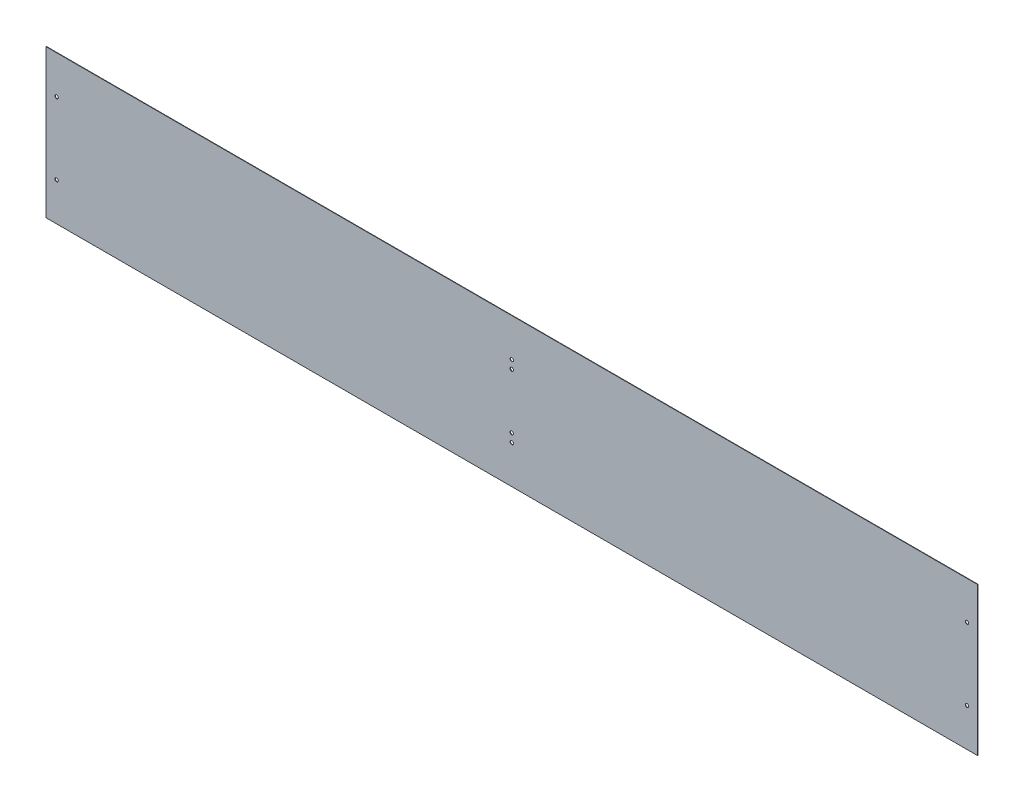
from build123d import *

# Parameters (mm, degrees)
SKETCH1_W           = 440
SKETCH1_H           = 0.2
BOSS_EXTRUDE1_DEPTH = 70
SKETCH2_R           = 0.8
CUT_EXTRUDE1_DEPTH  = 231.868014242


with BuildPart() as part:
    # Sketch1 → Boss-Extrude1 (new body)
    with BuildSketch(Plane(origin=(0, 0, 0), x_dir=(1, 0, 0), z_dir=(0, 1, 0))):
        Rectangle(SKETCH1_W, SKETCH1_H)
    extrude(amount=BOSS_EXTRUDE1_DEPTH)

    # Sketch2 → Cut-Extrude1 (cut, through all)
    with BuildSketch(Plane(origin=(0, 0, -0.1), x_dir=(-1, 0, 0), z_dir=(0, 0, -1))):
        with Locations((-215, 18)):
            Circle(SKETCH2_R)
        with Locations((-215, 52)):
            Circle(SKETCH2_R)
        with Locations((0, 52)):
            Circle(SKETCH2_R)
        with Locations((0, 22)):
            Circle(SKETCH2_R)
        with Locations((0, 18)):
            Circle(SKETCH2_R)
        with Locations((0, 48)):
            Circle(SKETCH2_R)
        with Locations((215, 18)):
            Circle(SKETCH2_R)
        with Locations((215, 52)):
            Circle(SKETCH2_R)
    extrude(amount=-CUT_EXTRUDE1_DEPTH, mode=Mode.SUBTRACT)


solid = part.part
